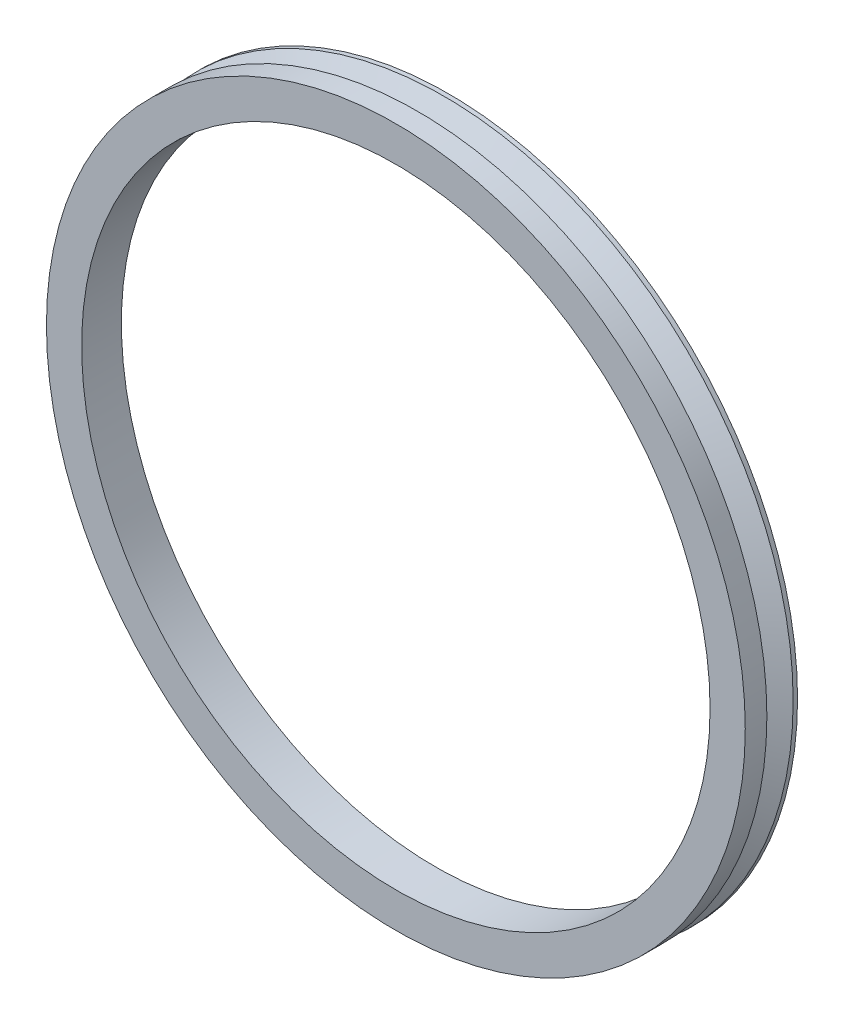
from build123d import *


with BuildPart() as part:
    # Esquisse1 → Base-R_volution (revolve)
    with BuildSketch(Plane(origin=(0, 0, 0), x_dir=(0, 0, -1), z_dir=(1, 0, 0)), mode=Mode.PRIVATE) as base_r_volution_sk:
        Polygon((0, 62.5), (7.9, 62.5), (10.4, 69.5), (9.525, 69.5), (6.336795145, 63.9), (4.298561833, 69.5), (0, 69.5), align=None)
    revolve(base_r_volution_sk.sketch.rotate(Axis((0, 0, 0), (0, 0, -1)), 90), axis=Axis((0, 0, 0), (0, 0, -1)))


solid = part.part
